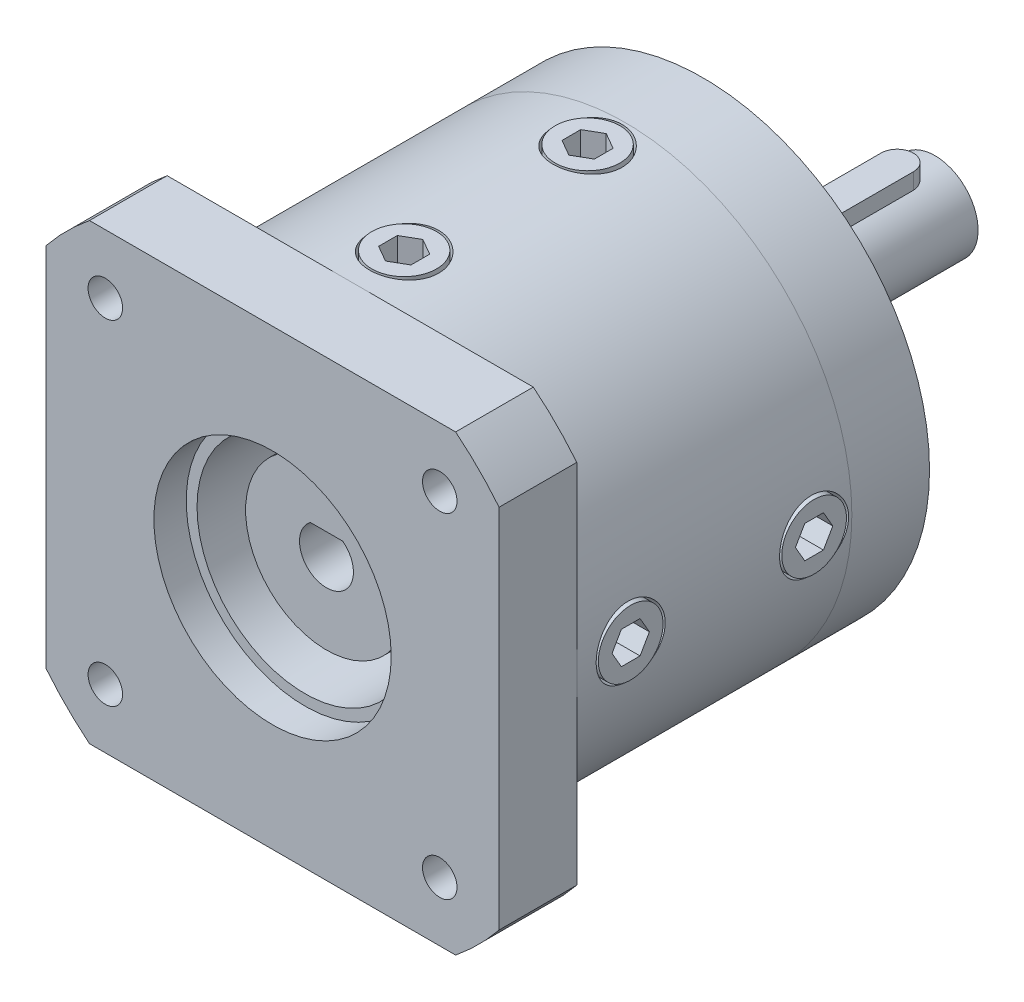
from build123d import *

# Parameters (mm, degrees)
SKETCH_1_R                  = 1.6
EXTRUDE_1_DEPTH             = 7.2
SKETCH_2_R                  = 21
EXTRUDE_2_DEPTH             = 1.5
SKETCH_3_R                  = 21
EXTRUDE_3_DEPTH             = 24
SKETCH_4_R                  = 21
EXTRUDE_4_DEPTH             = 7.2
SKETCH_5_R                  = 12.5
SKETCH_5_R_2                = 11
EXTRUDE_5_DEPTH             = 2
SKETCH_6_R                  = 11
CUT_EXTRUDE_1_DEPTH         = 3
SKETCH_9_R                  = 3
CUT_EXTRUDE_4_DEPTH         = 5
HOLE_WIZARD_M4_1_AT_2_COUNT = 2
HOLE_WIZARD_M4_1_AT_2_PITCH = 24.748737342
HOLE_WIZARD_M4_1_AT_3_COUNT = 2
HOLE_WIZARD_M4_1_AT_3_PITCH = 24.748737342
HOLE_WIZARD_M4_1_AT_4_COUNT = 2
HOLE_WIZARD_M4_1_AT_4_PITCH = 35
HOLE_WIZARD_M4_1_AT_5_COUNT = 2
HOLE_WIZARD_M4_1_AT_5_PITCH = 17.5
SKETCH_13_R                 = 3.2
CUT_EXTRUDE_5_DEPTH         = 5
SKETCH_14_R                 = 3
EXTRUDE_6_DEPTH             = 5
SKETCH_15_R                 = 3.2
CUT_EXTRUDE_7_DEPTH         = 5
SKETCH_16_R                 = 3
EXTRUDE_7_DEPTH             = 5
SKETCH_17_R                 = 3.2
CUT_EXTRUDE_8_DEPTH         = 5
SKETCH_18_R                 = 3
EXTRUDE_8_DEPTH             = 5
SKETCH_19_R                 = 3.2
CUT_EXTRUDE_9_DEPTH         = 5
SKETCH_20_R                 = 3
EXTRUDE_9_DEPTH             = 5
EXTRUDE_START               = -2
SKETCH_21_R                 = 4
EXTRUDE_10_DEPTH            = 21.5
SKETCH_26_R                 = 0.5
EXTRUDE_12_DEPTH            = 1
EXTRUDE_START_2             = 2.2
EXTRUDE_13_DEPTH            = 3
SKETCH_28_R                 = 10
CUT_EXTRUDE_10_DEPTH        = 13
SKETCH_30_R                 = 7.5
EXTRUDE_14_DEPTH            = 11
CUT_EXTRUDE_11_DEPTH        = 7
SKETCH_33_W                 = 1.25
SKETCH_33_H                 = 5.501


with BuildPart() as part:
    # Sketch 1 → Extrude 1 (new body)
    with BuildSketch(Plane.XY):
        with BuildLine():
            Line((-16.970562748, -21), (16.970562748, -21))
            ThreePointArc((16.970562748, -21), (19.091883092, -19.091883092), (21, -16.970562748))
            Line((21, -16.970562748), (21, 16.970562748))
            ThreePointArc((21, 16.970562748), (19.091883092, 19.091883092), (16.970562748, 21))
            Line((16.970562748, 21), (-16.970562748, 21))
            ThreePointArc((-16.970562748, 21), (-19.091883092, 19.091883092), (-21, 16.970562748))
            Line((-21, 16.970562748), (-21, -16.970562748))
            ThreePointArc((-21, -16.970562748), (-19.091883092, -19.091883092), (-16.970562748, -21))
        make_face()
        with Locations((-15.5, 15.5)):
            Circle(SKETCH_1_R, mode=Mode.SUBTRACT)
        with Locations((15.5, 15.5)):
            Circle(SKETCH_1_R, mode=Mode.SUBTRACT)
        with Locations((15.5, -15.5)):
            Circle(SKETCH_1_R, mode=Mode.SUBTRACT)
        with Locations((-15.5, -15.5)):
            Circle(SKETCH_1_R, mode=Mode.SUBTRACT)
    extrude(amount=EXTRUDE_1_DEPTH)

    # Sketch 2 → Extrude 2 (add)
    with BuildSketch(Plane(origin=(0, 0, 0), x_dir=(-1, 0, 0), z_dir=(0, 0, -1))):
        Circle(SKETCH_2_R)
    extrude(amount=EXTRUDE_2_DEPTH)

    # Sketch 6 → Cut-Extrude 1 (cut)
    with BuildSketch(Plane.XY.offset(7.2)):
        with Locations(Location((0, 0, 0), (0, 0, 180))):
            Circle(SKETCH_6_R)
    extrude(amount=-CUT_EXTRUDE_1_DEPTH, mode=Mode.SUBTRACT)

    # Sketch 9 → Cut-Extrude 4 (cut)
    with BuildSketch(Plane(origin=(0, 0, -1.5), x_dir=(-1, 0, 0), z_dir=(0, 0, -1))):
        with Locations((-15.5, 15.5)):
            Circle(SKETCH_9_R)
        with Locations((15.5, 15.5)):
            Circle(SKETCH_9_R)
        with Locations((15.5, -15.5)):
            Circle(SKETCH_9_R)
        with Locations((-15.5, -15.5)):
            Circle(SKETCH_9_R)
    extrude(amount=-CUT_EXTRUDE_4_DEPTH, mode=Mode.SUBTRACT)


with BuildPart() as body_2:
    # Sketch 3 → Extrude 3 (new body)
    with BuildSketch(Plane(origin=(0, 0, -1.5), x_dir=(-1, 0, 0), z_dir=(0, 0, -1))):
        Circle(SKETCH_3_R)
    extrude(amount=EXTRUDE_3_DEPTH)

    # Sketch 13 → Cut-Extrude 5 (cut)
    with BuildSketch(Plane.ZY.offset(21)):
        with Locations(Location((-22, 0, 0), (0, 0, 270))):
            Circle(SKETCH_13_R)
        with Locations(Location((-5, 0, 0), (0, 0, 270))):
            Circle(SKETCH_13_R)
    extrude(amount=-CUT_EXTRUDE_5_DEPTH, mode=Mode.SUBTRACT)

    # Sketch 14 → Extrude 6 (add)
    # profile 1 of 2: a face of its own
    with BuildSketch(Plane.ZY.offset(16)):
        with Locations(Location((-22, 0, 0), (0, 0, 270))):
            Circle(SKETCH_14_R)
        Polygon((-20.267949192, 0), (-21.133974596, 1.5), (-22.866025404, 1.5), (-23.732050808, 0), (-22.866025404, -1.5), (-21.133974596, -1.5), align=None, mode=Mode.SUBTRACT)
    # profile 2 of 2: a face of its own
    with BuildSketch(Plane.ZY.offset(16)):
        with Locations(Location((-5, 0, 0), (0, 0, 270))):
            Circle(SKETCH_14_R)
        Polygon((-3.267949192, 0), (-4.133974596, 1.5), (-5.866025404, 1.5), (-6.732050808, 0), (-5.866025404, -1.5), (-4.133974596, -1.5), align=None, mode=Mode.SUBTRACT)
    extrude(amount=EXTRUDE_6_DEPTH)

    # Sketch 15 → Cut-Extrude 7 (cut)
    with BuildSketch(Plane(origin=(0, 21, 0), x_dir=(1, 0, 0), z_dir=(0, 1, 0))):
        with Locations(Location((0, 22, 0), (0, 0, 180))):
            Circle(SKETCH_15_R)
        with Locations(Location((0, 5, 0), (0, 0, 180))):
            Circle(SKETCH_15_R)
    extrude(amount=-CUT_EXTRUDE_7_DEPTH, mode=Mode.SUBTRACT)

    # Sketch 16 → Extrude 7 (add)
    # profile 1 of 2: a face of its own
    with BuildSketch(Plane(origin=(0, 16, 0), x_dir=(1, 0, 0), z_dir=(0, 1, 0))):
        with Locations(Location((0, 22, 0), (0, 0, 180))):
            Circle(SKETCH_16_R)
        Polygon((0, 20.267949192), (1.5, 21.133974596), (1.5, 22.866025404), (0, 23.732050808), (-1.5, 22.866025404), (-1.5, 21.133974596), align=None, mode=Mode.SUBTRACT)
    # profile 2 of 2: a face of its own
    with BuildSketch(Plane(origin=(0, 16, 0), x_dir=(1, 0, 0), z_dir=(0, 1, 0))):
        with Locations(Location((0, 5, 0), (0, 0, 180))):
            Circle(SKETCH_16_R)
        Polygon((0, 3.267949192), (1.5, 4.133974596), (1.5, 5.866025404), (0, 6.732050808), (-1.5, 5.866025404), (-1.5, 4.133974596), align=None, mode=Mode.SUBTRACT)
    extrude(amount=EXTRUDE_7_DEPTH)

    # Sketch 17 → Cut-Extrude 8 (cut)
    with BuildSketch(Plane(origin=(21, 0, 0), x_dir=(0, 0, -1), z_dir=(1, 0, 0))):
        with Locations(Location((22, 0, 0), (0, 0, 270))):
            Circle(SKETCH_17_R)
        with Locations(Location((5, 0, 0), (0, 0, 270))):
            Circle(SKETCH_17_R)
    extrude(amount=-CUT_EXTRUDE_8_DEPTH, mode=Mode.SUBTRACT)

    # Sketch 18 → Extrude 8 (add)
    # profile 1 of 2: a face of its own
    with BuildSketch(Plane(origin=(16, 0, 0), x_dir=(0, 0, -1), z_dir=(1, 0, 0))):
        with Locations(Location((5, 0, 0), (0, 0, 270))):
            Circle(SKETCH_18_R)
        Polygon((6.732050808, 0), (5.866025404, 1.5), (4.133974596, 1.5), (3.267949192, 0), (4.133974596, -1.5), (5.866025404, -1.5), align=None, mode=Mode.SUBTRACT)
    # profile 2 of 2: a face of its own
    with BuildSketch(Plane(origin=(16, 0, 0), x_dir=(0, 0, -1), z_dir=(1, 0, 0))):
        with Locations(Location((22, 0, 0), (0, 0, 270))):
            Circle(SKETCH_18_R)
        Polygon((23.732050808, 0), (22.866025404, 1.5), (21.133974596, 1.5), (20.267949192, 0), (21.133974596, -1.5), (22.866025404, -1.5), align=None, mode=Mode.SUBTRACT)
    extrude(amount=EXTRUDE_8_DEPTH)

    # Sketch 19 → Cut-Extrude 9 (cut)
    with BuildSketch(Plane.XZ.offset(21)):
        with Locations(Location((0, -5, 0), (0, 0, 180))):
            Circle(SKETCH_19_R)
        with Locations(Location((0, -22, 0), (0, 0, 180))):
            Circle(SKETCH_19_R)
    extrude(amount=-CUT_EXTRUDE_9_DEPTH, mode=Mode.SUBTRACT)

    # Sketch 20 → Extrude 9 (add)
    # profile 1 of 2: a face of its own
    with BuildSketch(Plane.XZ.offset(16)):
        with Locations(Location((0, -5, 0), (0, 0, 180))):
            Circle(SKETCH_20_R)
        Polygon((0, -6.732050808), (1.5, -5.866025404), (1.5, -4.133974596), (0, -3.267949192), (-1.5, -4.133974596), (-1.5, -5.866025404), align=None, mode=Mode.SUBTRACT)
    # profile 2 of 2: a face of its own
    with BuildSketch(Plane.XZ.offset(16)):
        with Locations(Location((0, -22, 0), (0, 0, 180))):
            Circle(SKETCH_20_R)
        Polygon((0, -23.732050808), (1.5, -22.866025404), (1.5, -21.133974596), (0, -20.267949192), (-1.5, -21.133974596), (-1.5, -22.866025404), align=None, mode=Mode.SUBTRACT)
    extrude(amount=EXTRUDE_9_DEPTH)


with BuildPart() as body_3:
    # Sketch 4 → Extrude 4 (new body)
    with BuildSketch(Plane(origin=(0, 0, -25.5), x_dir=(-1, 0, 0), z_dir=(0, 0, -1))):
        Circle(SKETCH_4_R)
    extrude(amount=EXTRUDE_4_DEPTH)

    # Sketch 5 → Extrude 5 (add)
    with BuildSketch(Plane(origin=(0, 0, -32.7), x_dir=(-1, 0, 0), z_dir=(0, 0, -1))):
        Circle(SKETCH_5_R)
        Circle(SKETCH_5_R_2, mode=Mode.SUBTRACT)
    extrude(amount=EXTRUDE_5_DEPTH)

    # Sketch 12 → Hole Wizard M4 _1 (revolve, cut)
    with BuildSketch(Plane(origin=(0, 17.5, -32.7), x_dir=(0, 1, 0), z_dir=(1, 0, 0))):
        Polygon((0, 0), (0, 6.991420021), (1.65, 6), (1.65, 0), align=None)
    hole_wizard_m4_1 = revolve(axis=Axis((0, 17.5, -39.05), (0, 0, 1)), mode=Mode.SUBTRACT)

    # Hole Wizard M4 _1 at 2: Hole Wizard M4 _1 ×2
    with Locations(*[Vector(-0.7071067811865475, -0.7071067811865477, 0) * (i * HOLE_WIZARD_M4_1_AT_2_PITCH) for i in range(1, HOLE_WIZARD_M4_1_AT_2_COUNT)]):
        add(hole_wizard_m4_1, mode=Mode.SUBTRACT)

    # Hole Wizard M4 _1 at 3: Hole Wizard M4 _1 ×2
    with Locations(*[Vector(0.7071067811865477, -0.7071067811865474, 0) * (i * HOLE_WIZARD_M4_1_AT_3_PITCH) for i in range(1, HOLE_WIZARD_M4_1_AT_3_COUNT)]):
        add(hole_wizard_m4_1, mode=Mode.SUBTRACT)

    # Hole Wizard M4 _1 at 4: Hole Wizard M4 _1 ×2
    with Locations(*[(0, -i * HOLE_WIZARD_M4_1_AT_4_PITCH, 0) for i in range(1, HOLE_WIZARD_M4_1_AT_4_COUNT)]):
        add(hole_wizard_m4_1, mode=Mode.SUBTRACT)

    # Hole Wizard M4 _1 at 5: Hole Wizard M4 _1 ×2
    with Locations(*[(0, -i * HOLE_WIZARD_M4_1_AT_5_PITCH, 0) for i in range(1, HOLE_WIZARD_M4_1_AT_5_COUNT)]):
        add(hole_wizard_m4_1, mode=Mode.SUBTRACT)

    # Sketch 21 → Extrude 10 (add)
    with BuildSketch(Plane(origin=(0, 0, -34.7), x_dir=(-1, 0, 0), z_dir=(0, 0, -1)).offset(EXTRUDE_START)):
        Circle(SKETCH_21_R)
    extrude(amount=EXTRUDE_10_DEPTH)

    # Sketch 23 → Hole Wizard M3 _1 (revolve, cut)
    with BuildSketch(Plane(origin=(0, 0, -54.2), x_dir=(0, 1, 0), z_dir=(1, 0, 0))):
        Polygon((0, 0), (0, 12.251075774), (1.25, 11.5), (1.25, 0), align=None)
    revolve(axis=Axis((0, 0, -60.55), (0, 0, 1)), mode=Mode.SUBTRACT)

    # Sketch 26 → Extrude 12 (add)
    with BuildSketch(Plane(origin=(0, 0, -32.7), x_dir=(-1, 0, 0), z_dir=(0, 0, -1))):
        with BuildLine():
            Line((-0.3, 9.285), (-2.958837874, 8.816175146))
            Line((-2.958837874, 8.816175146), (-3.721805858, 5.673128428))
            ThreePointArc((-3.721805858, 5.673128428), (0, -6.785), (3.721805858, 5.673128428))
            Line((3.721805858, 5.673128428), (2.958837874, 8.816175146))
            Line((2.958837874, 8.816175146), (0.3, 9.285))
            Line((0.3, 9.285), (0.3, 5.785))
            Line((0.3, 5.785), (-0.3, 5.785))
            Line((-0.3, 5.785), (-0.3, 9.285))
        make_face()
        with Locations((-1.629047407, 7.58689081)):
            Circle(SKETCH_26_R, mode=Mode.SUBTRACT)
        with Locations(Location((1.629047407, 7.58689081, 0), (0, 0, 180))):
            Circle(SKETCH_26_R, mode=Mode.SUBTRACT)
    extrude(amount=EXTRUDE_12_DEPTH)

    # Sketch 27 → Extrude 13 (add)
    with BuildSketch(Plane(origin=(0, 0, 0), x_dir=(1, 0, 0), z_dir=(0, 1, 0)).offset(EXTRUDE_START_2)):
        with BuildLine():
            Line((-1.5, 39.7), (-1.5, 50.7))
            ThreePointArc((-1.5, 50.7), (0, 52.2), (1.5, 50.7))
            Line((1.5, 50.7), (1.5, 39.7))
            ThreePointArc((1.5, 39.7), (0, 38.2), (-1.5, 39.7))
        make_face()
    extrude(amount=EXTRUDE_13_DEPTH)


with BuildPart() as cut_extrude_10_tool:
    # Sketch 28 → Cut-Extrude 10 (new body)
    with BuildSketch(Plane.XY.offset(4.2)):
        Circle(SKETCH_28_R)
    extrude(amount=-CUT_EXTRUDE_10_DEPTH)


with BuildPart() as part_1:
    add(part.part)

    # Cut-Extrude 10: cut by cut_extrude_10_tool
    add(cut_extrude_10_tool.part, mode=Mode.SUBTRACT)



with BuildPart() as body_2_1:
    add(body_2.part)

    # Cut-Extrude 10: cut by cut_extrude_10_tool
    add(cut_extrude_10_tool.part, mode=Mode.SUBTRACT)


with BuildPart() as part_2:
    add(part_1.part)

    add(body_2_1.part)  # Extrude 14 merges body 2
    # Sketch 30 → Extrude 14 (add)
    with BuildSketch(Plane.XY.offset(-8.8)):
        Circle(SKETCH_30_R)
    extrude(amount=EXTRUDE_14_DEPTH)

    # Sketch 31 → Cut-Extrude 11 (cut)
    with BuildSketch(Plane.XY.offset(2.2)):
        with BuildLine():
            Line((-1.5, 2), (1.5, 2))
            ThreePointArc((1.5, 2), (0, -2.5), (-1.5, 2))
        make_face()
    extrude(amount=-CUT_EXTRUDE_11_DEPTH, mode=Mode.SUBTRACT)

    # Sketch 33 → Hole Wizard M3 _2 (revolve, cut)
    with BuildSketch(Plane(origin=(0, 2, 0), x_dir=(0, 0, -1), z_dir=(1, 0, 0))):
        with Locations((0.625, 2.7505)):
            Rectangle(SKETCH_33_W, SKETCH_33_H)
    revolve(axis=Axis((0, -4.35, 0), (0, 1, 0)), mode=Mode.SUBTRACT)


solid = Compound([body_3.part, part_2.part])
